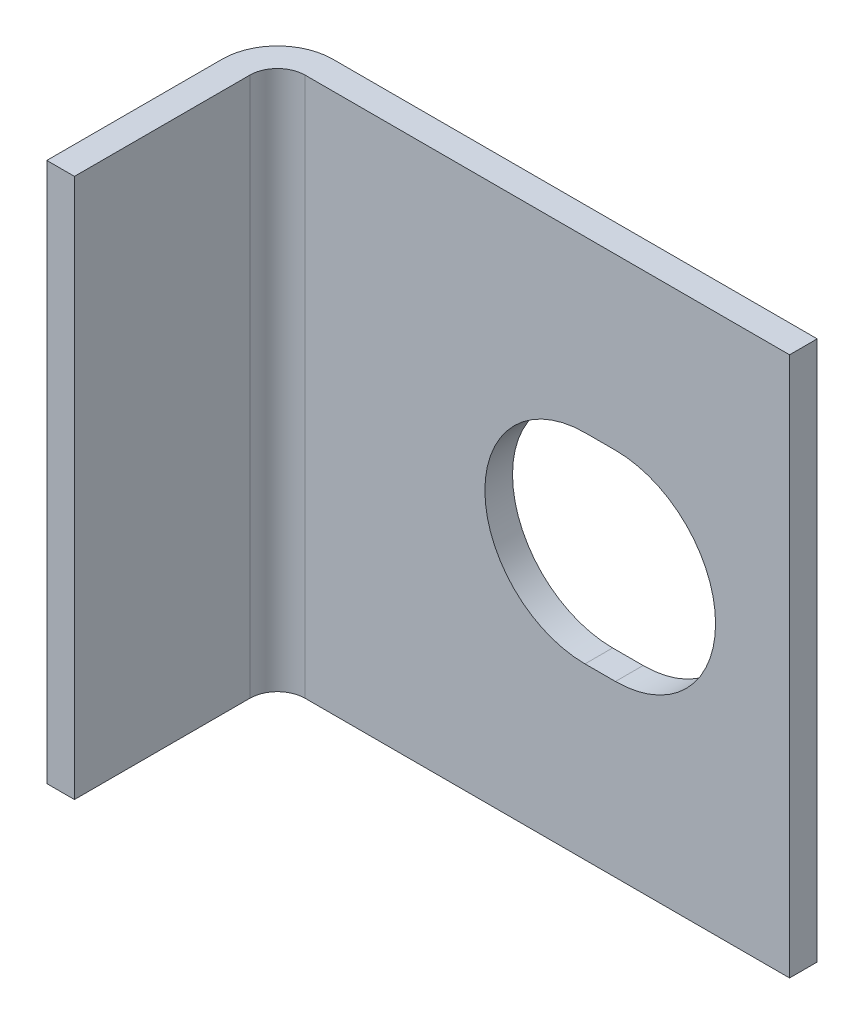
ISO-10303-21;
HEADER;
FILE_DESCRIPTION(('STEP AP214'),'2;1');
FILE_NAME('part.step','',(''),(''),'','','');
FILE_SCHEMA(('AUTOMOTIVE_DESIGN { 1 0 10303 214 1 1 1 1 }'));
ENDSEC;
DATA;
#1=APPLICATION_CONTEXT('core data for automotive mechanical design processes');
#2=APPLICATION_PROTOCOL_DEFINITION('international standard','automotive_design',2000,#1);
#3=PRODUCT_CONTEXT('',#1,'mechanical');
#4=PRODUCT('Part','Part','',(#3));
#5=PRODUCT_RELATED_PRODUCT_CATEGORY('part','',(#4));
#6=PRODUCT_DEFINITION_FORMATION('','',#4);
#7=PRODUCT_DEFINITION_CONTEXT('part definition',#1,'design');
#8=PRODUCT_DEFINITION('design','',#6,#7);
#9=PRODUCT_DEFINITION_SHAPE('','',#8);
#10=(LENGTH_UNIT() NAMED_UNIT(*) SI_UNIT(.MILLI.,.METRE.));
#11=(NAMED_UNIT(*) PLANE_ANGLE_UNIT() SI_UNIT($,.RADIAN.));
#12=(NAMED_UNIT(*) SI_UNIT($,.STERADIAN.) SOLID_ANGLE_UNIT());
#13=UNCERTAINTY_MEASURE_WITH_UNIT(LENGTH_MEASURE(1.E-05),#10,'distance_accuracy_value','');
#14=(GEOMETRIC_REPRESENTATION_CONTEXT(3) GLOBAL_UNCERTAINTY_ASSIGNED_CONTEXT((#13)) GLOBAL_UNIT_ASSIGNED_CONTEXT((#10,
#11,#12)) REPRESENTATION_CONTEXT('',''));
#15=CARTESIAN_POINT('',(0.,0.,0.));
#16=DIRECTION('',(0.,0.,1.));
#17=DIRECTION('',(1.,0.,0.));
#18=AXIS2_PLACEMENT_3D('',#15,#16,#17);
#19=CARTESIAN_POINT('',(-6.78,6.2,1.27));
#20=DIRECTION('',(0.,-1.,0.));
#21=DIRECTION('',(0.,0.,-1.));
#22=AXIS2_PLACEMENT_3D('',#19,#20,#21);
#23=CYLINDRICAL_SURFACE('',#22,1.27);
#24=CARTESIAN_POINT('',(-6.78,-6.2,1.27));
#25=DIRECTION('',(0.,1.,0.));
#26=DIRECTION('',(0.,0.,-1.));
#27=AXIS2_PLACEMENT_3D('',#24,#25,#26);
#28=CIRCLE('',#27,1.27);
#29=CARTESIAN_POINT('',(-6.78,-6.2,0.));
#30=VERTEX_POINT('',#29);
#31=CARTESIAN_POINT('',(-8.05,-6.2,1.27));
#32=VERTEX_POINT('',#31);
#33=EDGE_CURVE('E135',#30,#32,#28,.T.);
#34=ORIENTED_EDGE('',*,*,#33,.T.);
#35=DIRECTION('',(0.,-1.,0.));
#36=VECTOR('',#35,1.);
#37=CARTESIAN_POINT('',(-8.05,6.2,1.27));
#38=LINE('',#37,#36);
#39=CARTESIAN_POINT('',(-8.05,6.2,1.27));
#40=VERTEX_POINT('',#39);
#41=EDGE_CURVE('E9',#40,#32,#38,.T.);
#42=ORIENTED_EDGE('',*,*,#41,.F.);
#43=CARTESIAN_POINT('',(-6.78,6.2,1.27));
#44=DIRECTION('',(0.,1.,0.));
#45=DIRECTION('',(0.,0.,-1.));
#46=AXIS2_PLACEMENT_3D('',#43,#44,#45);
#47=CIRCLE('',#46,1.27);
#48=CARTESIAN_POINT('',(-6.78,6.2,0.));
#49=VERTEX_POINT('',#48);
#50=EDGE_CURVE('E139',#49,#40,#47,.T.);
#51=ORIENTED_EDGE('',*,*,#50,.F.);
#52=DIRECTION('',(0.,-1.,0.));
#53=VECTOR('',#52,1.);
#54=CARTESIAN_POINT('',(-6.78,6.2,0.));
#55=LINE('',#54,#53);
#56=EDGE_CURVE('E157',#49,#30,#55,.T.);
#57=ORIENTED_EDGE('',*,*,#56,.T.);
#58=EDGE_LOOP('',(#34,#42,#51,#57));
#59=FACE_BOUND('',#58,.T.);
#60=ADVANCED_FACE('F14',(#59),#23,.T.);
#61=CARTESIAN_POINT('',(-8.05,6.2,1.27));
#62=DIRECTION('',(1.,0.,0.));
#63=DIRECTION('',(0.,0.,-1.));
#64=AXIS2_PLACEMENT_3D('',#61,#62,#63);
#65=PLANE('',#64);
#66=DIRECTION('',(0.,0.,1.));
#67=VECTOR('',#66,1.);
#68=CARTESIAN_POINT('',(-8.05,-6.2,1.27));
#69=LINE('',#68,#67);
#70=CARTESIAN_POINT('',(-8.05,-6.2,5.3));
#71=VERTEX_POINT('',#70);
#72=EDGE_CURVE('E160',#32,#71,#69,.T.);
#73=ORIENTED_EDGE('',*,*,#72,.T.);
#74=DIRECTION('',(0.,-1.,0.));
#75=VECTOR('',#74,1.);
#76=CARTESIAN_POINT('',(-8.05,6.2,5.3));
#77=LINE('',#76,#75);
#78=CARTESIAN_POINT('',(-8.05,6.2,5.3));
#79=VERTEX_POINT('',#78);
#80=EDGE_CURVE('E21',#79,#71,#77,.T.);
#81=ORIENTED_EDGE('',*,*,#80,.F.);
#82=DIRECTION('',(0.,0.,1.));
#83=VECTOR('',#82,1.);
#84=CARTESIAN_POINT('',(-8.05,6.2,1.27));
#85=LINE('',#84,#83);
#86=EDGE_CURVE('E142',#40,#79,#85,.T.);
#87=ORIENTED_EDGE('',*,*,#86,.F.);
#88=ORIENTED_EDGE('',*,*,#41,.T.);
#89=EDGE_LOOP('',(#73,#81,#87,#88));
#90=FACE_BOUND('',#89,.T.);
#91=ADVANCED_FACE('F217',(#90),#65,.F.);
#92=CARTESIAN_POINT('',(-8.05,6.2,5.3));
#93=DIRECTION('',(0.,0.,-1.));
#94=DIRECTION('',(-1.,0.,0.));
#95=AXIS2_PLACEMENT_3D('',#92,#93,#94);
#96=PLANE('',#95);
#97=DIRECTION('',(1.,0.,0.));
#98=VECTOR('',#97,1.);
#99=CARTESIAN_POINT('',(-8.05,-6.2,5.3));
#100=LINE('',#99,#98);
#101=CARTESIAN_POINT('',(-7.415,-6.2,5.3));
#102=VERTEX_POINT('',#101);
#103=EDGE_CURVE('E162',#71,#102,#100,.T.);
#104=ORIENTED_EDGE('',*,*,#103,.T.);
#105=DIRECTION('',(0.,-1.,0.));
#106=VECTOR('',#105,1.);
#107=CARTESIAN_POINT('',(-7.415,6.2,5.3));
#108=LINE('',#107,#106);
#109=CARTESIAN_POINT('',(-7.415,6.2,5.3));
#110=VERTEX_POINT('',#109);
#111=EDGE_CURVE('E187',#110,#102,#108,.T.);
#112=ORIENTED_EDGE('',*,*,#111,.F.);
#113=DIRECTION('',(1.,0.,0.));
#114=VECTOR('',#113,1.);
#115=CARTESIAN_POINT('',(-8.05,6.2,5.3));
#116=LINE('',#115,#114);
#117=EDGE_CURVE('E145',#79,#110,#116,.T.);
#118=ORIENTED_EDGE('',*,*,#117,.F.);
#119=ORIENTED_EDGE('',*,*,#80,.T.);
#120=EDGE_LOOP('',(#104,#112,#118,#119));
#121=FACE_BOUND('',#120,.T.);
#122=ADVANCED_FACE('F194',(#121),#96,.F.);
#123=CARTESIAN_POINT('',(-7.415,6.2,1.27));
#124=DIRECTION('',(-1.,0.,0.));
#125=DIRECTION('',(0.,0.,1.));
#126=AXIS2_PLACEMENT_3D('',#123,#124,#125);
#127=PLANE('',#126);
#128=DIRECTION('',(0.,0.,-1.));
#129=VECTOR('',#128,1.);
#130=CARTESIAN_POINT('',(-7.415,-6.2,1.27));
#131=LINE('',#130,#129);
#132=CARTESIAN_POINT('',(-7.415,-6.2,1.27));
#133=VERTEX_POINT('',#132);
#134=EDGE_CURVE('E164',#102,#133,#131,.T.);
#135=ORIENTED_EDGE('',*,*,#134,.T.);
#136=DIRECTION('',(0.,-1.,0.));
#137=VECTOR('',#136,1.);
#138=CARTESIAN_POINT('',(-7.415,6.2,1.27));
#139=LINE('',#138,#137);
#140=CARTESIAN_POINT('',(-7.415,6.2,1.27));
#141=VERTEX_POINT('',#140);
#142=EDGE_CURVE('E184',#141,#133,#139,.T.);
#143=ORIENTED_EDGE('',*,*,#142,.F.);
#144=DIRECTION('',(0.,0.,-1.));
#145=VECTOR('',#144,1.);
#146=CARTESIAN_POINT('',(-7.415,6.2,1.27));
#147=LINE('',#146,#145);
#148=EDGE_CURVE('E147',#110,#141,#147,.T.);
#149=ORIENTED_EDGE('',*,*,#148,.F.);
#150=ORIENTED_EDGE('',*,*,#111,.T.);
#151=EDGE_LOOP('',(#135,#143,#149,#150));
#152=FACE_BOUND('',#151,.T.);
#153=ADVANCED_FACE('F205',(#152),#127,.F.);
#154=CARTESIAN_POINT('',(-6.78,6.2,1.27));
#155=DIRECTION('',(0.,-1.,0.));
#156=DIRECTION('',(0.,0.,-1.));
#157=AXIS2_PLACEMENT_3D('',#154,#155,#156);
#158=CYLINDRICAL_SURFACE('',#157,0.635);
#159=CARTESIAN_POINT('',(-6.78,-6.2,1.27));
#160=DIRECTION('',(0.,-1.,0.));
#161=DIRECTION('',(0.,0.,1.));
#162=AXIS2_PLACEMENT_3D('',#159,#160,#161);
#163=CIRCLE('',#162,0.635);
#164=CARTESIAN_POINT('',(-6.78,-6.2,0.635));
#165=VERTEX_POINT('',#164);
#166=EDGE_CURVE('E166',#133,#165,#163,.T.);
#167=ORIENTED_EDGE('',*,*,#166,.T.);
#168=DIRECTION('',(0.,-1.,0.));
#169=VECTOR('',#168,1.);
#170=CARTESIAN_POINT('',(-6.78,6.2,0.635));
#171=LINE('',#170,#169);
#172=CARTESIAN_POINT('',(-6.78,6.2,0.635));
#173=VERTEX_POINT('',#172);
#174=EDGE_CURVE('E181',#173,#165,#171,.T.);
#175=ORIENTED_EDGE('',*,*,#174,.F.);
#176=CARTESIAN_POINT('',(-6.78,6.2,1.27));
#177=DIRECTION('',(0.,-1.,0.));
#178=DIRECTION('',(0.,0.,1.));
#179=AXIS2_PLACEMENT_3D('',#176,#177,#178);
#180=CIRCLE('',#179,0.635);
#181=EDGE_CURVE('E149',#141,#173,#180,.T.);
#182=ORIENTED_EDGE('',*,*,#181,.F.);
#183=ORIENTED_EDGE('',*,*,#142,.T.);
#184=EDGE_LOOP('',(#167,#175,#182,#183));
#185=FACE_BOUND('',#184,.T.);
#186=ADVANCED_FACE('F209',(#185),#158,.F.);
#187=CARTESIAN_POINT('',(4.35,6.2,0.635));
#188=DIRECTION('',(0.,0.,-1.));
#189=DIRECTION('',(-1.,0.,0.));
#190=AXIS2_PLACEMENT_3D('',#187,#188,#189);
#191=PLANE('',#190);
#192=DIRECTION('',(-1.,0.,0.));
#193=VECTOR('',#192,1.);
#194=CARTESIAN_POINT('',(-0.35,-2.3,0.635));
#195=LINE('',#194,#193);
#196=CARTESIAN_POINT('',(0.35,-2.3,0.635));
#197=VERTEX_POINT('',#196);
#198=CARTESIAN_POINT('',(-0.35,-2.3,0.635));
#199=VERTEX_POINT('',#198);
#200=EDGE_CURVE('E110',#197,#199,#195,.T.);
#201=ORIENTED_EDGE('',*,*,#200,.T.);
#202=CARTESIAN_POINT('',(-0.35,0.,0.635));
#203=DIRECTION('',(0.,0.,-1.));
#204=DIRECTION('',(-1.,0.,0.));
#205=AXIS2_PLACEMENT_3D('',#202,#203,#204);
#206=CIRCLE('',#205,2.3);
#207=CARTESIAN_POINT('',(-0.35,2.3,0.635));
#208=VERTEX_POINT('',#207);
#209=EDGE_CURVE('E104',#199,#208,#206,.T.);
#210=ORIENTED_EDGE('',*,*,#209,.T.);
#211=DIRECTION('',(1.,0.,0.));
#212=VECTOR('',#211,1.);
#213=CARTESIAN_POINT('',(-0.35,2.3,0.635));
#214=LINE('',#213,#212);
#215=CARTESIAN_POINT('',(0.35,2.3,0.635));
#216=VERTEX_POINT('',#215);
#217=EDGE_CURVE('E113',#208,#216,#214,.T.);
#218=ORIENTED_EDGE('',*,*,#217,.T.);
#219=CARTESIAN_POINT('',(0.35,0.,0.635));
#220=DIRECTION('',(0.,0.,-1.));
#221=DIRECTION('',(-1.,0.,0.));
#222=AXIS2_PLACEMENT_3D('',#219,#220,#221);
#223=CIRCLE('',#222,2.3);
#224=EDGE_CURVE('E28',#216,#197,#223,.T.);
#225=ORIENTED_EDGE('',*,*,#224,.T.);
#226=EDGE_LOOP('',(#201,#210,#218,#225));
#227=FACE_BOUND('',#226,.T.);
#228=DIRECTION('',(1.,0.,0.));
#229=VECTOR('',#228,1.);
#230=CARTESIAN_POINT('',(4.35,-6.2,0.635));
#231=LINE('',#230,#229);
#232=CARTESIAN_POINT('',(4.35,-6.2,0.635));
#233=VERTEX_POINT('',#232);
#234=EDGE_CURVE('E168',#165,#233,#231,.T.);
#235=ORIENTED_EDGE('',*,*,#234,.T.);
#236=DIRECTION('',(0.,-1.,0.));
#237=VECTOR('',#236,1.);
#238=CARTESIAN_POINT('',(4.35,6.2,0.635));
#239=LINE('',#238,#237);
#240=CARTESIAN_POINT('',(4.35,6.2,0.635));
#241=VERTEX_POINT('',#240);
#242=EDGE_CURVE('E178',#241,#233,#239,.T.);
#243=ORIENTED_EDGE('',*,*,#242,.F.);
#244=DIRECTION('',(1.,0.,0.));
#245=VECTOR('',#244,1.);
#246=CARTESIAN_POINT('',(4.35,6.2,0.635));
#247=LINE('',#246,#245);
#248=EDGE_CURVE('E151',#173,#241,#247,.T.);
#249=ORIENTED_EDGE('',*,*,#248,.F.);
#250=ORIENTED_EDGE('',*,*,#174,.T.);
#251=EDGE_LOOP('',(#235,#243,#249,#250));
#252=FACE_BOUND('',#251,.T.);
#253=ADVANCED_FACE('F117',(#227,#252),#191,.F.);
#254=CARTESIAN_POINT('',(4.35,6.2,0.635));
#255=DIRECTION('',(-1.,0.,0.));
#256=DIRECTION('',(0.,0.,1.));
#257=AXIS2_PLACEMENT_3D('',#254,#255,#256);
#258=PLANE('',#257);
#259=DIRECTION('',(0.,0.,-1.));
#260=VECTOR('',#259,1.);
#261=CARTESIAN_POINT('',(4.35,-6.2,0.635));
#262=LINE('',#261,#260);
#263=CARTESIAN_POINT('',(4.35,-6.2,0.));
#264=VERTEX_POINT('',#263);
#265=EDGE_CURVE('E170',#233,#264,#262,.T.);
#266=ORIENTED_EDGE('',*,*,#265,.T.);
#267=DIRECTION('',(0.,-1.,0.));
#268=VECTOR('',#267,1.);
#269=CARTESIAN_POINT('',(4.35,6.2,0.));
#270=LINE('',#269,#268);
#271=CARTESIAN_POINT('',(4.35,6.2,0.));
#272=VERTEX_POINT('',#271);
#273=EDGE_CURVE('E175',#272,#264,#270,.T.);
#274=ORIENTED_EDGE('',*,*,#273,.F.);
#275=DIRECTION('',(0.,0.,-1.));
#276=VECTOR('',#275,1.);
#277=CARTESIAN_POINT('',(4.35,6.2,0.635));
#278=LINE('',#277,#276);
#279=EDGE_CURVE('E153',#241,#272,#278,.T.);
#280=ORIENTED_EDGE('',*,*,#279,.F.);
#281=ORIENTED_EDGE('',*,*,#242,.T.);
#282=EDGE_LOOP('',(#266,#274,#280,#281));
#283=FACE_BOUND('',#282,.T.);
#284=ADVANCED_FACE('F228',(#283),#258,.F.);
#285=CARTESIAN_POINT('',(4.35,6.2,0.));
#286=DIRECTION('',(0.,0.,1.));
#287=DIRECTION('',(1.,0.,0.));
#288=AXIS2_PLACEMENT_3D('',#285,#286,#287);
#289=PLANE('',#288);
#290=DIRECTION('',(1.,0.,0.));
#291=VECTOR('',#290,1.);
#292=CARTESIAN_POINT('',(-0.35,2.3,0.));
#293=LINE('',#292,#291);
#294=CARTESIAN_POINT('',(-0.35,2.3,0.));
#295=VERTEX_POINT('',#294);
#296=CARTESIAN_POINT('',(0.35,2.3,0.));
#297=VERTEX_POINT('',#296);
#298=EDGE_CURVE('E129',#295,#297,#293,.T.);
#299=ORIENTED_EDGE('',*,*,#298,.F.);
#300=CARTESIAN_POINT('',(-0.35,0.,0.));
#301=DIRECTION('',(0.,0.,-1.));
#302=DIRECTION('',(-1.,0.,0.));
#303=AXIS2_PLACEMENT_3D('',#300,#301,#302);
#304=CIRCLE('',#303,2.3);
#305=CARTESIAN_POINT('',(-0.35,-2.3,0.));
#306=VERTEX_POINT('',#305);
#307=EDGE_CURVE('E36',#306,#295,#304,.T.);
#308=ORIENTED_EDGE('',*,*,#307,.F.);
#309=DIRECTION('',(-1.,0.,0.));
#310=VECTOR('',#309,1.);
#311=CARTESIAN_POINT('',(-0.35,-2.3,0.));
#312=LINE('',#311,#310);
#313=CARTESIAN_POINT('',(0.35,-2.3,0.));
#314=VERTEX_POINT('',#313);
#315=EDGE_CURVE('E120',#314,#306,#312,.T.);
#316=ORIENTED_EDGE('',*,*,#315,.F.);
#317=CARTESIAN_POINT('',(0.35,0.,0.));
#318=DIRECTION('',(0.,0.,-1.));
#319=DIRECTION('',(-1.,0.,0.));
#320=AXIS2_PLACEMENT_3D('',#317,#318,#319);
#321=CIRCLE('',#320,2.3);
#322=EDGE_CURVE('E123',#297,#314,#321,.T.);
#323=ORIENTED_EDGE('',*,*,#322,.F.);
#324=EDGE_LOOP('',(#299,#308,#316,#323));
#325=FACE_BOUND('',#324,.T.);
#326=DIRECTION('',(-1.,0.,0.));
#327=VECTOR('',#326,1.);
#328=CARTESIAN_POINT('',(4.35,-6.2,0.));
#329=LINE('',#328,#327);
#330=EDGE_CURVE('E143',#264,#30,#329,.T.);
#331=ORIENTED_EDGE('',*,*,#330,.T.);
#332=ORIENTED_EDGE('',*,*,#56,.F.);
#333=DIRECTION('',(-1.,0.,0.));
#334=VECTOR('',#333,1.);
#335=CARTESIAN_POINT('',(4.35,6.2,0.));
#336=LINE('',#335,#334);
#337=EDGE_CURVE('E155',#272,#49,#336,.T.);
#338=ORIENTED_EDGE('',*,*,#337,.F.);
#339=ORIENTED_EDGE('',*,*,#273,.T.);
#340=EDGE_LOOP('',(#331,#332,#338,#339));
#341=FACE_BOUND('',#340,.T.);
#342=ADVANCED_FACE('F223',(#325,#341),#289,.F.);
#343=CARTESIAN_POINT('',(-6.78,6.2,1.27));
#344=DIRECTION('',(0.,-1.,0.));
#345=DIRECTION('',(0.,0.,-1.));
#346=AXIS2_PLACEMENT_3D('',#343,#344,#345);
#347=PLANE('',#346);
#348=ORIENTED_EDGE('',*,*,#50,.T.);
#349=ORIENTED_EDGE('',*,*,#86,.T.);
#350=ORIENTED_EDGE('',*,*,#117,.T.);
#351=ORIENTED_EDGE('',*,*,#148,.T.);
#352=ORIENTED_EDGE('',*,*,#181,.T.);
#353=ORIENTED_EDGE('',*,*,#248,.T.);
#354=ORIENTED_EDGE('',*,*,#279,.T.);
#355=ORIENTED_EDGE('',*,*,#337,.T.);
#356=EDGE_LOOP('',(#348,#349,#350,#351,#352,#353,#354,#355));
#357=FACE_BOUND('',#356,.T.);
#358=ADVANCED_FACE('F213',(#357),#347,.F.);
#359=CARTESIAN_POINT('',(-6.78,-6.2,1.27));
#360=DIRECTION('',(0.,-1.,0.));
#361=DIRECTION('',(0.,0.,-1.));
#362=AXIS2_PLACEMENT_3D('',#359,#360,#361);
#363=PLANE('',#362);
#364=ORIENTED_EDGE('',*,*,#33,.F.);
#365=ORIENTED_EDGE('',*,*,#330,.F.);
#366=ORIENTED_EDGE('',*,*,#265,.F.);
#367=ORIENTED_EDGE('',*,*,#234,.F.);
#368=ORIENTED_EDGE('',*,*,#166,.F.);
#369=ORIENTED_EDGE('',*,*,#134,.F.);
#370=ORIENTED_EDGE('',*,*,#103,.F.);
#371=ORIENTED_EDGE('',*,*,#72,.F.);
#372=EDGE_LOOP('',(#364,#365,#366,#367,#368,#369,#370,#371));
#373=FACE_BOUND('',#372,.T.);
#374=ADVANCED_FACE('F200',(#373),#363,.T.);
#375=CARTESIAN_POINT('',(-0.35,0.,0.635));
#376=DIRECTION('',(0.,0.,-1.));
#377=DIRECTION('',(-1.,0.,0.));
#378=AXIS2_PLACEMENT_3D('',#375,#376,#377);
#379=CYLINDRICAL_SURFACE('',#378,2.3);
#380=ORIENTED_EDGE('',*,*,#307,.T.);
#381=DIRECTION('',(0.,0.,-1.));
#382=VECTOR('',#381,1.);
#383=CARTESIAN_POINT('',(-0.35,2.3,0.635));
#384=LINE('',#383,#382);
#385=EDGE_CURVE('E100',#208,#295,#384,.T.);
#386=ORIENTED_EDGE('',*,*,#385,.F.);
#387=ORIENTED_EDGE('',*,*,#209,.F.);
#388=DIRECTION('',(0.,0.,-1.));
#389=VECTOR('',#388,1.);
#390=CARTESIAN_POINT('',(-0.35,-2.3,0.635));
#391=LINE('',#390,#389);
#392=EDGE_CURVE('E133',#199,#306,#391,.T.);
#393=ORIENTED_EDGE('',*,*,#392,.T.);
#394=EDGE_LOOP('',(#380,#386,#387,#393));
#395=FACE_BOUND('',#394,.T.);
#396=ADVANCED_FACE('F102',(#395),#379,.F.);
#397=CARTESIAN_POINT('',(-0.35,-2.3,0.635));
#398=DIRECTION('',(0.,-1.,0.));
#399=DIRECTION('',(0.,0.,-1.));
#400=AXIS2_PLACEMENT_3D('',#397,#398,#399);
#401=PLANE('',#400);
#402=ORIENTED_EDGE('',*,*,#315,.T.);
#403=ORIENTED_EDGE('',*,*,#392,.F.);
#404=ORIENTED_EDGE('',*,*,#200,.F.);
#405=DIRECTION('',(0.,0.,-1.));
#406=VECTOR('',#405,1.);
#407=CARTESIAN_POINT('',(0.35,-2.3,0.635));
#408=LINE('',#407,#406);
#409=EDGE_CURVE('E136',#197,#314,#408,.T.);
#410=ORIENTED_EDGE('',*,*,#409,.T.);
#411=EDGE_LOOP('',(#402,#403,#404,#410));
#412=FACE_BOUND('',#411,.T.);
#413=ADVANCED_FACE('F318',(#412),#401,.F.);
#414=CARTESIAN_POINT('',(0.35,0.,0.635));
#415=DIRECTION('',(0.,0.,-1.));
#416=DIRECTION('',(-1.,0.,0.));
#417=AXIS2_PLACEMENT_3D('',#414,#415,#416);
#418=CYLINDRICAL_SURFACE('',#417,2.3);
#419=ORIENTED_EDGE('',*,*,#322,.T.);
#420=ORIENTED_EDGE('',*,*,#409,.F.);
#421=ORIENTED_EDGE('',*,*,#224,.F.);
#422=DIRECTION('',(0.,0.,-1.));
#423=VECTOR('',#422,1.);
#424=CARTESIAN_POINT('',(0.35,2.3,0.635));
#425=LINE('',#424,#423);
#426=EDGE_CURVE('E109',#216,#297,#425,.T.);
#427=ORIENTED_EDGE('',*,*,#426,.T.);
#428=EDGE_LOOP('',(#419,#420,#421,#427));
#429=FACE_BOUND('',#428,.T.);
#430=ADVANCED_FACE('F326',(#429),#418,.F.);
#431=CARTESIAN_POINT('',(-0.35,2.3,0.635));
#432=DIRECTION('',(0.,1.,0.));
#433=DIRECTION('',(0.,0.,1.));
#434=AXIS2_PLACEMENT_3D('',#431,#432,#433);
#435=PLANE('',#434);
#436=ORIENTED_EDGE('',*,*,#298,.T.);
#437=ORIENTED_EDGE('',*,*,#426,.F.);
#438=ORIENTED_EDGE('',*,*,#217,.F.);
#439=ORIENTED_EDGE('',*,*,#385,.T.);
#440=EDGE_LOOP('',(#436,#437,#438,#439));
#441=FACE_BOUND('',#440,.T.);
#442=ADVANCED_FACE('F114',(#441),#435,.F.);
#443=CLOSED_SHELL('',(#60,#91,#122,#153,#186,#253,#284,#342,#358,#374,#396,#413,#430,#442));
#444=MANIFOLD_SOLID_BREP('B1',#443);
#445=ADVANCED_BREP_SHAPE_REPRESENTATION('',(#18,#444),#14);
#446=SHAPE_DEFINITION_REPRESENTATION(#9,#445);
ENDSEC;
END-ISO-10303-21;
